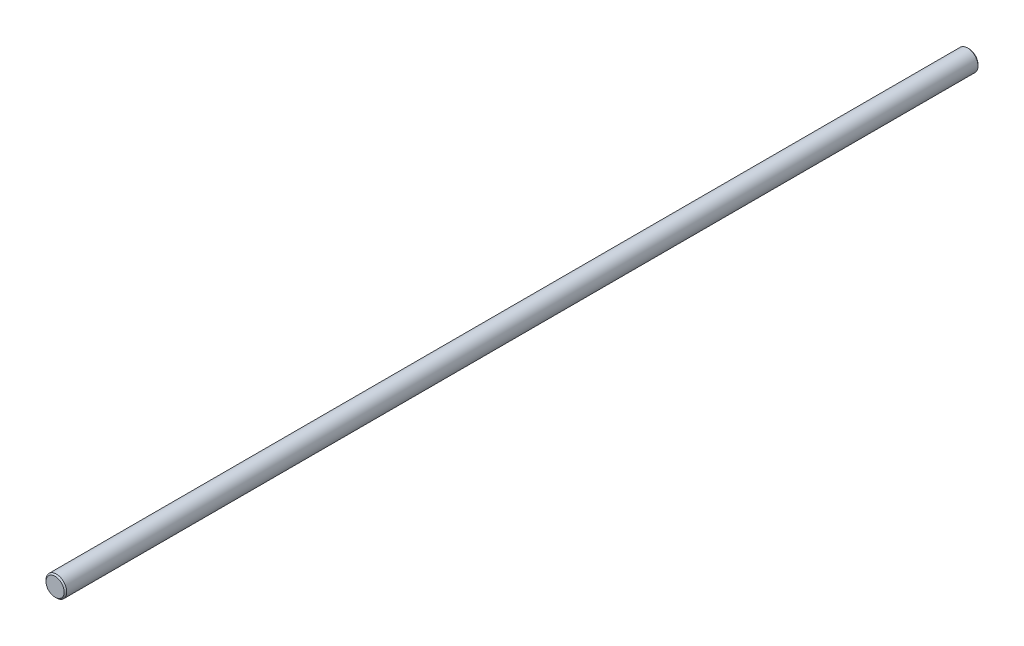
from build123d import *


with BuildPart() as part:
    # Sketch 1 → Revolve 1 (revolve)
    with BuildSketch(Plane(origin=(0, 0, 0), x_dir=(1, 0, 0), z_dir=(0, 1, 0))):
        Polygon((3.5, 176), (0, 176), (0, -176), (3.5, -176), (4, -175.5), (4, 175.5), align=None)
    revolve(axis=Axis((0, 0, -176), (0, 0, 1)))


solid = part.part
